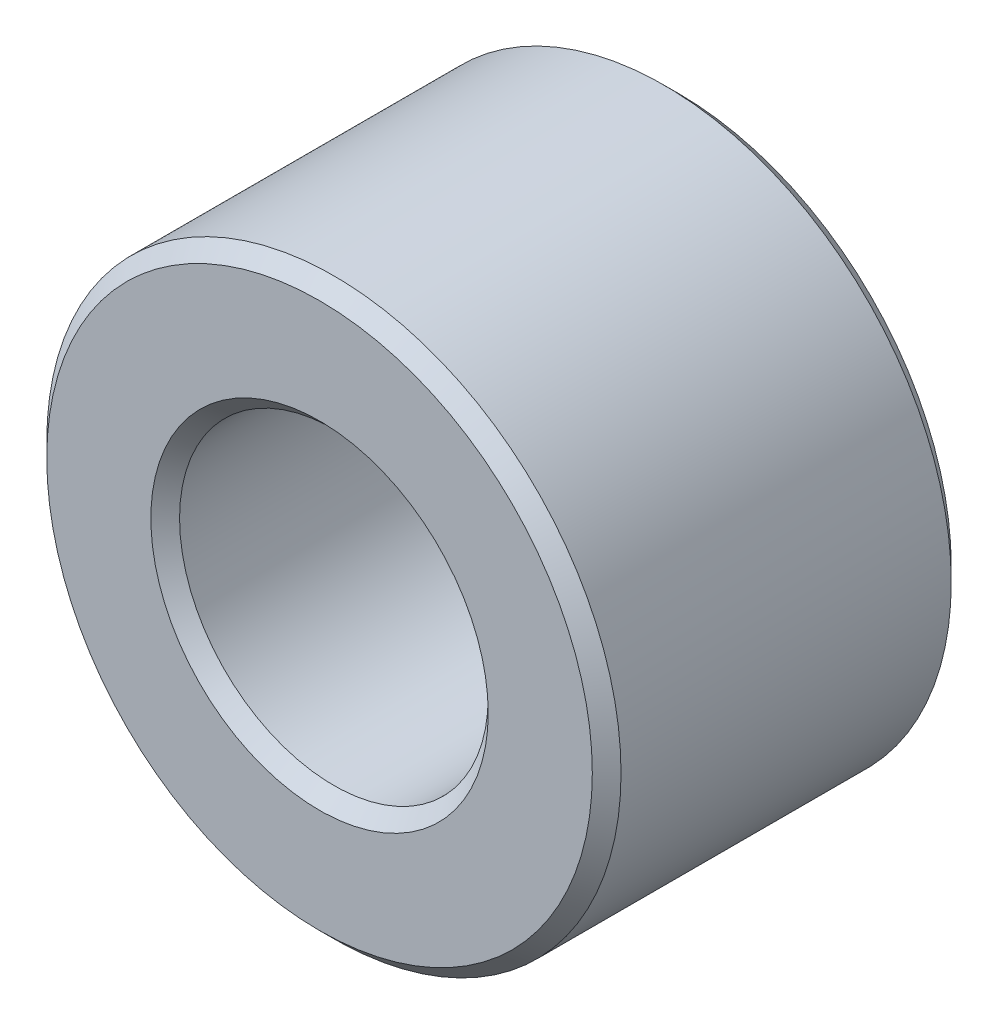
ISO-10303-21;
HEADER;
FILE_DESCRIPTION(('STEP AP214'),'2;1');
FILE_NAME('part.step','',(''),(''),'','','');
FILE_SCHEMA(('AUTOMOTIVE_DESIGN { 1 0 10303 214 1 1 1 1 }'));
ENDSEC;
DATA;
#1=APPLICATION_CONTEXT('core data for automotive mechanical design processes');
#2=APPLICATION_PROTOCOL_DEFINITION('international standard','automotive_design',2000,#1);
#3=PRODUCT_CONTEXT('',#1,'mechanical');
#4=PRODUCT('Part','Part','',(#3));
#5=PRODUCT_RELATED_PRODUCT_CATEGORY('part','',(#4));
#6=PRODUCT_DEFINITION_FORMATION('','',#4);
#7=PRODUCT_DEFINITION_CONTEXT('part definition',#1,'design');
#8=PRODUCT_DEFINITION('design','',#6,#7);
#9=PRODUCT_DEFINITION_SHAPE('','',#8);
#10=(LENGTH_UNIT() NAMED_UNIT(*) SI_UNIT(.MILLI.,.METRE.));
#11=(NAMED_UNIT(*) PLANE_ANGLE_UNIT() SI_UNIT($,.RADIAN.));
#12=(NAMED_UNIT(*) SI_UNIT($,.STERADIAN.) SOLID_ANGLE_UNIT());
#13=UNCERTAINTY_MEASURE_WITH_UNIT(LENGTH_MEASURE(1.E-05),#10,'distance_accuracy_value','');
#14=(GEOMETRIC_REPRESENTATION_CONTEXT(3) GLOBAL_UNCERTAINTY_ASSIGNED_CONTEXT((#13)) GLOBAL_UNIT_ASSIGNED_CONTEXT((#10,
#11,#12)) REPRESENTATION_CONTEXT('',''));
#15=CARTESIAN_POINT('',(0.,0.,0.));
#16=DIRECTION('',(0.,0.,1.));
#17=DIRECTION('',(1.,0.,0.));
#18=AXIS2_PLACEMENT_3D('',#15,#16,#17);
#19=CARTESIAN_POINT('',(0.,0.,2.5));
#20=DIRECTION('',(0.,0.,1.));
#21=DIRECTION('',(1.,0.,0.));
#22=AXIS2_PLACEMENT_3D('',#19,#20,#21);
#23=PLANE('',#22);
#24=CARTESIAN_POINT('',(0.,0.,2.5));
#25=DIRECTION('',(0.,0.,1.));
#26=DIRECTION('',(1.,0.,0.));
#27=AXIS2_PLACEMENT_3D('',#24,#25,#26);
#28=CIRCLE('',#27,2.35);
#29=CARTESIAN_POINT('',(2.35,0.,2.5));
#30=VERTEX_POINT('',#29);
#31=EDGE_CURVE('E10',#30,#30,#28,.F.);
#32=ORIENTED_EDGE('',*,*,#31,.T.);
#33=EDGE_LOOP('',(#32));
#34=FACE_BOUND('',#33,.T.);
#35=CARTESIAN_POINT('',(0.,0.,2.5));
#36=DIRECTION('',(0.,0.,1.));
#37=DIRECTION('',(1.,0.,0.));
#38=AXIS2_PLACEMENT_3D('',#35,#36,#37);
#39=CIRCLE('',#38,3.8);
#40=CARTESIAN_POINT('',(3.8,0.,2.5));
#41=VERTEX_POINT('',#40);
#42=EDGE_CURVE('E45',#41,#41,#39,.T.);
#43=ORIENTED_EDGE('',*,*,#42,.T.);
#44=EDGE_LOOP('',(#43));
#45=FACE_BOUND('',#44,.T.);
#46=ADVANCED_FACE('F37',(#34,#45),#23,.T.);
#47=CARTESIAN_POINT('',(0.,0.,-2.5));
#48=DIRECTION('',(0.,0.,1.));
#49=DIRECTION('',(1.,0.,0.));
#50=AXIS2_PLACEMENT_3D('',#47,#48,#49);
#51=PLANE('',#50);
#52=CARTESIAN_POINT('',(0.,0.,-2.5));
#53=DIRECTION('',(0.,0.,1.));
#54=DIRECTION('',(1.,0.,0.));
#55=AXIS2_PLACEMENT_3D('',#52,#53,#54);
#56=CIRCLE('',#55,3.8);
#57=CARTESIAN_POINT('',(3.8,0.,-2.5));
#58=VERTEX_POINT('',#57);
#59=EDGE_CURVE('E63',#58,#58,#56,.F.);
#60=ORIENTED_EDGE('',*,*,#59,.T.);
#61=EDGE_LOOP('',(#60));
#62=FACE_BOUND('',#61,.T.);
#63=CARTESIAN_POINT('',(0.,0.,-2.5));
#64=DIRECTION('',(0.,0.,1.));
#65=DIRECTION('',(1.,0.,0.));
#66=AXIS2_PLACEMENT_3D('',#63,#64,#65);
#67=CIRCLE('',#66,2.35);
#68=CARTESIAN_POINT('',(2.35,0.,-2.5));
#69=VERTEX_POINT('',#68);
#70=EDGE_CURVE('E67',#69,#69,#67,.T.);
#71=ORIENTED_EDGE('',*,*,#70,.T.);
#72=EDGE_LOOP('',(#71));
#73=FACE_BOUND('',#72,.T.);
#74=ADVANCED_FACE('F89',(#62,#73),#51,.F.);
#75=CARTESIAN_POINT('',(0.,0.,2.5));
#76=DIRECTION('',(0.,0.,-1.));
#77=DIRECTION('',(-1.,0.,0.));
#78=AXIS2_PLACEMENT_3D('',#75,#76,#77);
#79=CYLINDRICAL_SURFACE('',#78,4.);
#80=CARTESIAN_POINT('',(0.,0.,-2.3));
#81=DIRECTION('',(0.,0.,1.));
#82=DIRECTION('',(1.,0.,0.));
#83=AXIS2_PLACEMENT_3D('',#80,#81,#82);
#84=CIRCLE('',#83,4.);
#85=CARTESIAN_POINT('',(4.,0.,-2.3));
#86=VERTEX_POINT('',#85);
#87=EDGE_CURVE('E70',#86,#86,#84,.T.);
#88=ORIENTED_EDGE('',*,*,#87,.T.);
#89=EDGE_LOOP('',(#88));
#90=FACE_BOUND('',#89,.T.);
#91=CARTESIAN_POINT('',(0.,0.,2.3));
#92=DIRECTION('',(0.,0.,1.));
#93=DIRECTION('',(1.,0.,0.));
#94=AXIS2_PLACEMENT_3D('',#91,#92,#93);
#95=CIRCLE('',#94,4.);
#96=CARTESIAN_POINT('',(4.,0.,2.3));
#97=VERTEX_POINT('',#96);
#98=EDGE_CURVE('E74',#97,#97,#95,.F.);
#99=ORIENTED_EDGE('',*,*,#98,.T.);
#100=EDGE_LOOP('',(#99));
#101=FACE_BOUND('',#100,.T.);
#102=ADVANCED_FACE('F78',(#90,#101),#79,.T.);
#103=CARTESIAN_POINT('',(0.,0.,2.5));
#104=DIRECTION('',(0.,0.,-1.));
#105=DIRECTION('',(-1.,0.,0.));
#106=AXIS2_PLACEMENT_3D('',#103,#104,#105);
#107=CYLINDRICAL_SURFACE('',#106,2.15);
#108=CARTESIAN_POINT('',(0.,0.,-2.3));
#109=DIRECTION('',(0.,0.,1.));
#110=DIRECTION('',(1.,0.,0.));
#111=AXIS2_PLACEMENT_3D('',#108,#109,#110);
#112=CIRCLE('',#111,2.15);
#113=CARTESIAN_POINT('',(2.15,0.,-2.3));
#114=VERTEX_POINT('',#113);
#115=EDGE_CURVE('E52',#114,#114,#112,.F.);
#116=ORIENTED_EDGE('',*,*,#115,.T.);
#117=EDGE_LOOP('',(#116));
#118=FACE_BOUND('',#117,.T.);
#119=CARTESIAN_POINT('',(0.,0.,2.3));
#120=DIRECTION('',(0.,0.,1.));
#121=DIRECTION('',(1.,0.,0.));
#122=AXIS2_PLACEMENT_3D('',#119,#120,#121);
#123=CIRCLE('',#122,2.15);
#124=CARTESIAN_POINT('',(2.15,0.,2.3));
#125=VERTEX_POINT('',#124);
#126=EDGE_CURVE('E57',#125,#125,#123,.T.);
#127=ORIENTED_EDGE('',*,*,#126,.T.);
#128=EDGE_LOOP('',(#127));
#129=FACE_BOUND('',#128,.T.);
#130=ADVANCED_FACE('F97',(#118,#129),#107,.F.);
#131=CARTESIAN_POINT('',(0.,0.,-2.3));
#132=DIRECTION('',(0.,0.,1.));
#133=DIRECTION('',(1.,0.,0.));
#134=AXIS2_PLACEMENT_3D('',#131,#132,#133);
#135=CONICAL_SURFACE('',#134,4.,0.78539816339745);
#136=ORIENTED_EDGE('',*,*,#59,.F.);
#137=EDGE_LOOP('',(#136));
#138=FACE_BOUND('',#137,.T.);
#139=ORIENTED_EDGE('',*,*,#87,.F.);
#140=EDGE_LOOP('',(#139));
#141=FACE_BOUND('',#140,.T.);
#142=ADVANCED_FACE('F102',(#138,#141),#135,.T.);
#143=CARTESIAN_POINT('',(0.,0.,-2.5));
#144=DIRECTION('',(0.,0.,-1.));
#145=DIRECTION('',(-1.,0.,0.));
#146=AXIS2_PLACEMENT_3D('',#143,#144,#145);
#147=CONICAL_SURFACE('',#146,2.35,0.785398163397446);
#148=ORIENTED_EDGE('',*,*,#115,.F.);
#149=EDGE_LOOP('',(#148));
#150=FACE_BOUND('',#149,.T.);
#151=ORIENTED_EDGE('',*,*,#70,.F.);
#152=EDGE_LOOP('',(#151));
#153=FACE_BOUND('',#152,.T.);
#154=ADVANCED_FACE('F86',(#150,#153),#147,.F.);
#155=CARTESIAN_POINT('',(0.,0.,2.3));
#156=DIRECTION('',(0.,0.,1.));
#157=DIRECTION('',(1.,0.,0.));
#158=AXIS2_PLACEMENT_3D('',#155,#156,#157);
#159=CONICAL_SURFACE('',#158,2.15,0.785398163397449);
#160=ORIENTED_EDGE('',*,*,#31,.F.);
#161=EDGE_LOOP('',(#160));
#162=FACE_BOUND('',#161,.T.);
#163=ORIENTED_EDGE('',*,*,#126,.F.);
#164=EDGE_LOOP('',(#163));
#165=FACE_BOUND('',#164,.T.);
#166=ADVANCED_FACE('F82',(#162,#165),#159,.F.);
#167=CARTESIAN_POINT('',(0.,0.,2.5));
#168=DIRECTION('',(0.,0.,-1.));
#169=DIRECTION('',(-1.,0.,0.));
#170=AXIS2_PLACEMENT_3D('',#167,#168,#169);
#171=CONICAL_SURFACE('',#170,3.8,0.785398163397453);
#172=ORIENTED_EDGE('',*,*,#98,.F.);
#173=EDGE_LOOP('',(#172));
#174=FACE_BOUND('',#173,.T.);
#175=ORIENTED_EDGE('',*,*,#42,.F.);
#176=EDGE_LOOP('',(#175));
#177=FACE_BOUND('',#176,.T.);
#178=ADVANCED_FACE('F39',(#174,#177),#171,.T.);
#179=CLOSED_SHELL('',(#46,#74,#102,#130,#142,#154,#166,#178));
#180=MANIFOLD_SOLID_BREP('B2',#179);
#181=ADVANCED_BREP_SHAPE_REPRESENTATION('',(#18,#180),#14);
#182=SHAPE_DEFINITION_REPRESENTATION(#9,#181);
ENDSEC;
END-ISO-10303-21;
